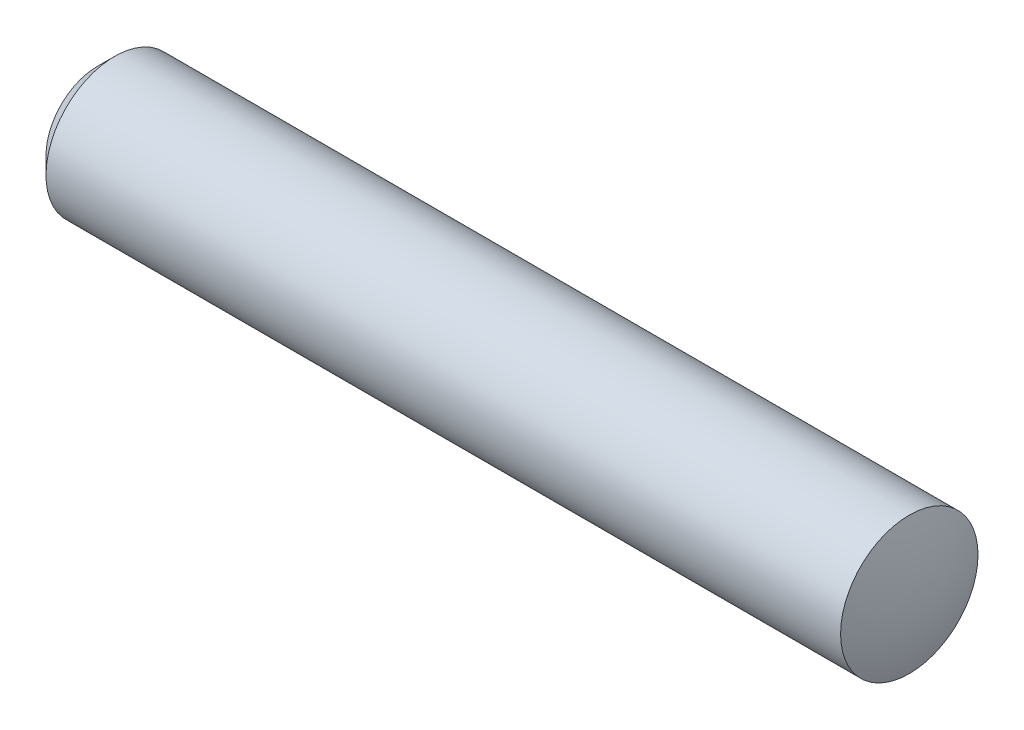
ISO-10303-21;
HEADER;
FILE_DESCRIPTION(('STEP AP214'),'2;1');
FILE_NAME('part.step','',(''),(''),'','','');
FILE_SCHEMA(('AUTOMOTIVE_DESIGN { 1 0 10303 214 1 1 1 1 }'));
ENDSEC;
DATA;
#1=APPLICATION_CONTEXT('core data for automotive mechanical design processes');
#2=APPLICATION_PROTOCOL_DEFINITION('international standard','automotive_design',2000,#1);
#3=PRODUCT_CONTEXT('',#1,'mechanical');
#4=PRODUCT('Part','Part','',(#3));
#5=PRODUCT_RELATED_PRODUCT_CATEGORY('part','',(#4));
#6=PRODUCT_DEFINITION_FORMATION('','',#4);
#7=PRODUCT_DEFINITION_CONTEXT('part definition',#1,'design');
#8=PRODUCT_DEFINITION('design','',#6,#7);
#9=PRODUCT_DEFINITION_SHAPE('','',#8);
#10=(LENGTH_UNIT() NAMED_UNIT(*) SI_UNIT(.MILLI.,.METRE.));
#11=(NAMED_UNIT(*) PLANE_ANGLE_UNIT() SI_UNIT($,.RADIAN.));
#12=(NAMED_UNIT(*) SI_UNIT($,.STERADIAN.) SOLID_ANGLE_UNIT());
#13=UNCERTAINTY_MEASURE_WITH_UNIT(LENGTH_MEASURE(1.E-05),#10,'distance_accuracy_value','');
#14=(GEOMETRIC_REPRESENTATION_CONTEXT(3) GLOBAL_UNCERTAINTY_ASSIGNED_CONTEXT((#13)) GLOBAL_UNIT_ASSIGNED_CONTEXT((#10,
#11,#12)) REPRESENTATION_CONTEXT('',''));
#15=CARTESIAN_POINT('',(0.,0.,0.));
#16=DIRECTION('',(0.,0.,1.));
#17=DIRECTION('',(1.,0.,0.));
#18=AXIS2_PLACEMENT_3D('',#15,#16,#17);
#19=CARTESIAN_POINT('',(-17.4976841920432,0.,0.));
#20=DIRECTION('',(-1.,0.,0.));
#21=DIRECTION('',(0.,1.,0.));
#22=AXIS2_PLACEMENT_3D('',#19,#20,#21);
#23=SPHERICAL_SURFACE('',#22,5.6);
#24=CARTESIAN_POINT('',(-12.1023158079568,0.,0.));
#25=DIRECTION('',(-1.,0.,0.));
#26=DIRECTION('',(0.,-1.,0.));
#27=AXIS2_PLACEMENT_3D('',#24,#25,#26);
#28=CIRCLE('',#27,1.5);
#29=CARTESIAN_POINT('',(-12.1023158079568,-1.5,0.));
#30=VERTEX_POINT('',#29);
#31=EDGE_CURVE('E10',#30,#30,#28,.T.);
#32=ORIENTED_EDGE('',*,*,#31,.T.);
#33=EDGE_LOOP('',(#32));
#34=FACE_BOUND('',#33,.T.);
#35=ADVANCED_FACE('F43',(#34),#23,.F.);
#36=CARTESIAN_POINT('',(-11.6023158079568,0.,0.));
#37=DIRECTION('',(1.,0.,0.));
#38=DIRECTION('',(0.,1.,0.));
#39=AXIS2_PLACEMENT_3D('',#36,#37,#38);
#40=CONICAL_SURFACE('',#39,2.,0.785398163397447);
#41=ORIENTED_EDGE('',*,*,#31,.F.);
#42=EDGE_LOOP('',(#41));
#43=FACE_BOUND('',#42,.T.);
#44=CARTESIAN_POINT('',(-11.6023158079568,0.,0.));
#45=DIRECTION('',(-1.,0.,0.));
#46=DIRECTION('',(0.,-1.,0.));
#47=AXIS2_PLACEMENT_3D('',#44,#45,#46);
#48=CIRCLE('',#47,2.);
#49=CARTESIAN_POINT('',(-11.6023158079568,-1.99999999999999,0.));
#50=VERTEX_POINT('',#49);
#51=EDGE_CURVE('E49',#50,#50,#48,.T.);
#52=ORIENTED_EDGE('',*,*,#51,.T.);
#53=EDGE_LOOP('',(#52));
#54=FACE_BOUND('',#53,.T.);
#55=ADVANCED_FACE('F69',(#43,#54),#40,.T.);
#56=CARTESIAN_POINT('',(-11.8976841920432,0.,0.));
#57=DIRECTION('',(-1.,0.,0.));
#58=DIRECTION('',(0.,-1.,0.));
#59=AXIS2_PLACEMENT_3D('',#56,#57,#58);
#60=CYLINDRICAL_SURFACE('',#59,2.);
#61=ORIENTED_EDGE('',*,*,#51,.F.);
#62=EDGE_LOOP('',(#61));
#63=FACE_BOUND('',#62,.T.);
#64=CARTESIAN_POINT('',(11.5283629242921,0.,0.));
#65=DIRECTION('',(-1.,0.,0.));
#66=DIRECTION('',(0.,-1.,0.));
#67=AXIS2_PLACEMENT_3D('',#64,#65,#66);
#68=CIRCLE('',#67,2.);
#69=CARTESIAN_POINT('',(11.5283629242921,-2.,0.));
#70=VERTEX_POINT('',#69);
#71=EDGE_CURVE('E53',#70,#70,#68,.T.);
#72=ORIENTED_EDGE('',*,*,#71,.T.);
#73=EDGE_LOOP('',(#72));
#74=FACE_BOUND('',#73,.T.);
#75=ADVANCED_FACE('F60',(#63,#74),#60,.T.);
#76=CARTESIAN_POINT('',(6.29768419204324,0.,0.));
#77=DIRECTION('',(-1.,0.,0.));
#78=DIRECTION('',(0.,1.,0.));
#79=AXIS2_PLACEMENT_3D('',#76,#77,#78);
#80=SPHERICAL_SURFACE('',#79,5.6);
#81=ORIENTED_EDGE('',*,*,#71,.F.);
#82=EDGE_LOOP('',(#81));
#83=FACE_BOUND('',#82,.T.);
#84=ADVANCED_FACE('F62',(#83),#80,.T.);
#85=CLOSED_SHELL('',(#35,#55,#75,#84));
#86=MANIFOLD_SOLID_BREP('B2',#85);
#87=ADVANCED_BREP_SHAPE_REPRESENTATION('',(#18,#86),#14);
#88=SHAPE_DEFINITION_REPRESENTATION(#9,#87);
ENDSEC;
END-ISO-10303-21;
